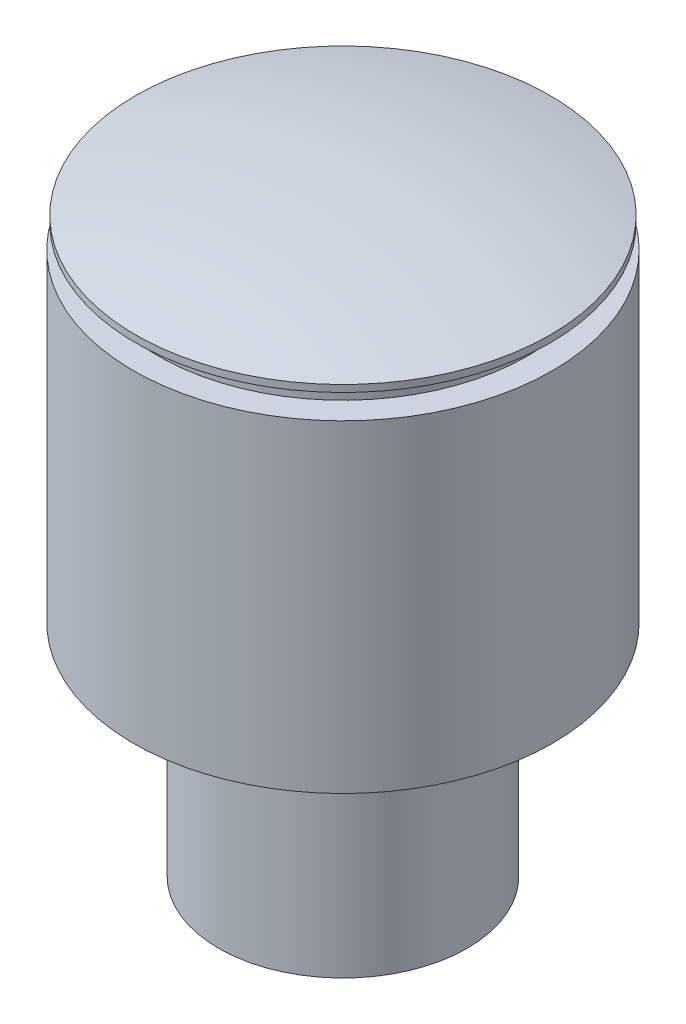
from build123d import *


with BuildPart() as part:
    # Sketch1 → Revolve1 (revolve)
    with BuildSketch(Plane.XY):
        with BuildLine():
            Line((0, 0), (5.3975, 0))
            Line((5.3975, 0), (5.3975, 9.5504))
            Line((5.3975, 9.5504), (9.092431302, 9.5504))
            Line((9.092431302, 9.5504), (9.092431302, 23.5618))
            Line((9.092431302, 23.5618), (8, 23.5618))
            Line((8, 23.5618), (8, 24.5618))
            Line((8, 24.5618), (9, 24.5618))
            Line((9, 24.5618), (9, 24.8618))
            ThreePointArc((9, 24.8618), (4.536154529, 25.71801895), (0, 26.004949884))
            Line((0, 26.004949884), (0, 0))
        make_face()
    revolve(axis=Axis((0, -1000, 0), (0, 1, 0)))


solid = part.part
